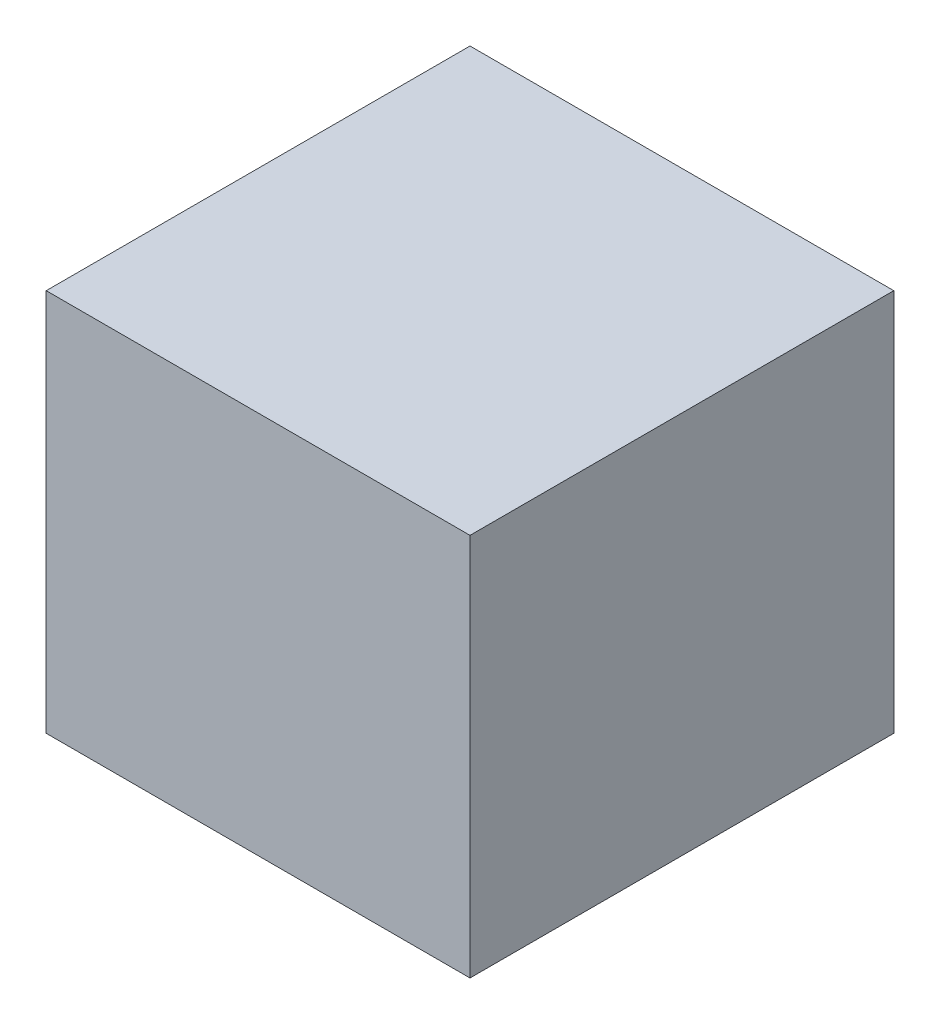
from build123d import *

# Parameters (mm, degrees)
SKETCH1_W      = 57.039491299
SKETCH1_H      = 57.039491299
EXTRUDE1_DEPTH = 51.598552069


with BuildPart() as part:
    # Sketch1 → Extrude1 (new body)
    with BuildSketch(Plane(origin=(0, 0, 0), x_dir=(1, 0, 0), z_dir=(0, 1, 0))):
        with Locations((28.51974565, 28.51974565)):
            Rectangle(SKETCH1_W, SKETCH1_H)
    extrude(amount=-EXTRUDE1_DEPTH)


solid = part.part
